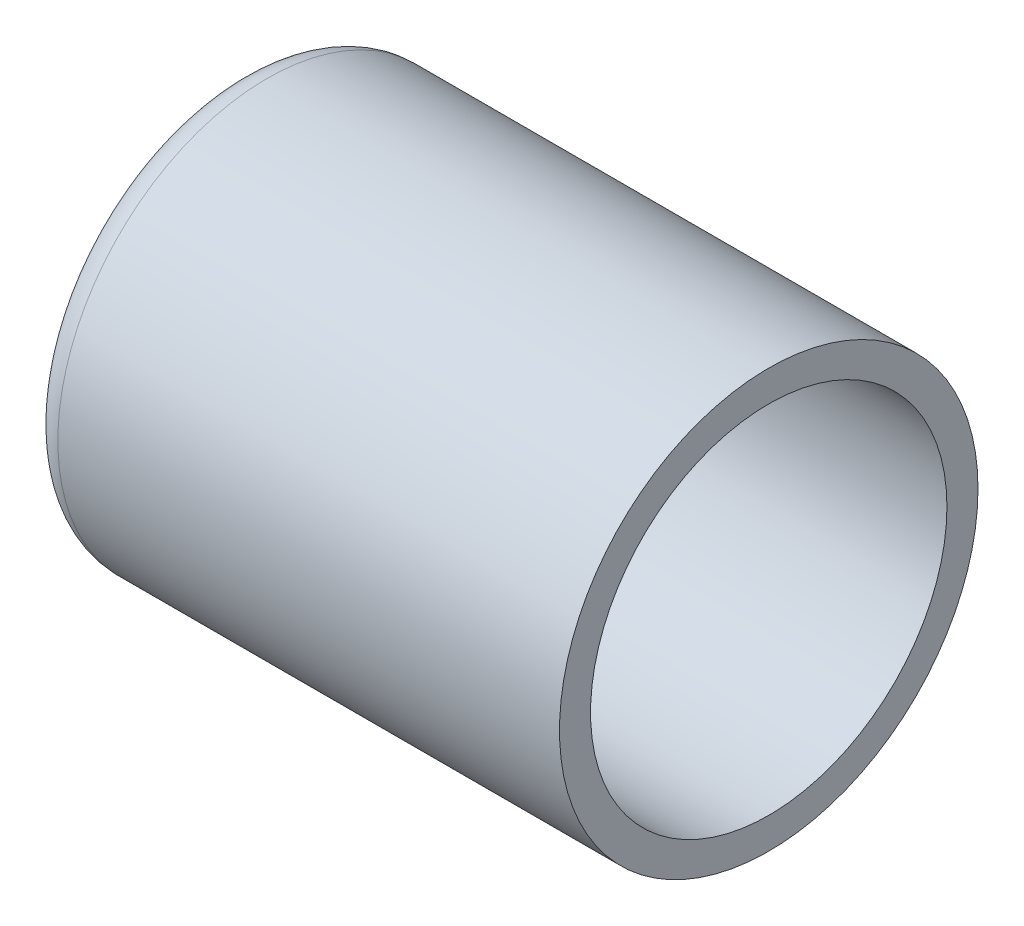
ISO-10303-21;
HEADER;
FILE_DESCRIPTION(('STEP AP214'),'2;1');
FILE_NAME('part.step','',(''),(''),'','','');
FILE_SCHEMA(('AUTOMOTIVE_DESIGN { 1 0 10303 214 1 1 1 1 }'));
ENDSEC;
DATA;
#1=APPLICATION_CONTEXT('core data for automotive mechanical design processes');
#2=APPLICATION_PROTOCOL_DEFINITION('international standard','automotive_design',2000,#1);
#3=PRODUCT_CONTEXT('',#1,'mechanical');
#4=PRODUCT('Part','Part','',(#3));
#5=PRODUCT_RELATED_PRODUCT_CATEGORY('part','',(#4));
#6=PRODUCT_DEFINITION_FORMATION('','',#4);
#7=PRODUCT_DEFINITION_CONTEXT('part definition',#1,'design');
#8=PRODUCT_DEFINITION('design','',#6,#7);
#9=PRODUCT_DEFINITION_SHAPE('','',#8);
#10=(LENGTH_UNIT() NAMED_UNIT(*) SI_UNIT(.MILLI.,.METRE.));
#11=(NAMED_UNIT(*) PLANE_ANGLE_UNIT() SI_UNIT($,.RADIAN.));
#12=(NAMED_UNIT(*) SI_UNIT($,.STERADIAN.) SOLID_ANGLE_UNIT());
#13=UNCERTAINTY_MEASURE_WITH_UNIT(LENGTH_MEASURE(1.E-05),#10,'distance_accuracy_value','');
#14=(GEOMETRIC_REPRESENTATION_CONTEXT(3) GLOBAL_UNCERTAINTY_ASSIGNED_CONTEXT((#13)) GLOBAL_UNIT_ASSIGNED_CONTEXT((#10,
#11,#12)) REPRESENTATION_CONTEXT('',''));
#15=CARTESIAN_POINT('',(0.,0.,0.));
#16=DIRECTION('',(0.,0.,1.));
#17=DIRECTION('',(1.,0.,0.));
#18=AXIS2_PLACEMENT_3D('',#15,#16,#17);
#19=CARTESIAN_POINT('',(14.097,0.,0.));
#20=DIRECTION('',(-1.,0.,0.));
#21=DIRECTION('',(0.,0.,1.));
#22=AXIS2_PLACEMENT_3D('',#19,#20,#21);
#23=CYLINDRICAL_SURFACE('',#22,5.5626);
#24=CARTESIAN_POINT('',(0.762000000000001,0.,0.));
#25=DIRECTION('',(1.,0.,0.));
#26=DIRECTION('',(0.,0.,-1.));
#27=AXIS2_PLACEMENT_3D('',#24,#25,#26);
#28=CIRCLE('',#27,5.5626);
#29=CARTESIAN_POINT('',(0.762000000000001,0.,-5.5626));
#30=VERTEX_POINT('',#29);
#31=EDGE_CURVE('E45',#30,#30,#28,.T.);
#32=ORIENTED_EDGE('',*,*,#31,.T.);
#33=EDGE_LOOP('',(#32));
#34=FACE_BOUND('',#33,.T.);
#35=CARTESIAN_POINT('',(14.097,0.,0.));
#36=DIRECTION('',(1.,0.,0.));
#37=DIRECTION('',(0.,0.,-1.));
#38=AXIS2_PLACEMENT_3D('',#35,#36,#37);
#39=CIRCLE('',#38,5.5626);
#40=CARTESIAN_POINT('',(14.097,0.,-5.5626));
#41=VERTEX_POINT('',#40);
#42=EDGE_CURVE('E50',#41,#41,#39,.T.);
#43=ORIENTED_EDGE('',*,*,#42,.F.);
#44=EDGE_LOOP('',(#43));
#45=FACE_BOUND('',#44,.T.);
#46=ADVANCED_FACE('F30',(#34,#45),#23,.T.);
#47=CARTESIAN_POINT('',(14.097,0.,0.));
#48=DIRECTION('',(1.,0.,0.));
#49=DIRECTION('',(0.,0.,-1.));
#50=AXIS2_PLACEMENT_3D('',#47,#48,#49);
#51=PLANE('',#50);
#52=CARTESIAN_POINT('',(14.097,0.,0.));
#53=DIRECTION('',(1.,0.,0.));
#54=DIRECTION('',(0.,0.,-1.));
#55=AXIS2_PLACEMENT_3D('',#52,#53,#54);
#56=CIRCLE('',#55,4.7371);
#57=CARTESIAN_POINT('',(14.097,0.,-4.7371));
#58=VERTEX_POINT('',#57);
#59=EDGE_CURVE('E54',#58,#58,#56,.T.);
#60=ORIENTED_EDGE('',*,*,#59,.F.);
#61=EDGE_LOOP('',(#60));
#62=FACE_BOUND('',#61,.T.);
#63=ORIENTED_EDGE('',*,*,#42,.T.);
#64=EDGE_LOOP('',(#63));
#65=FACE_BOUND('',#64,.T.);
#66=ADVANCED_FACE('F78',(#62,#65),#51,.T.);
#67=CARTESIAN_POINT('',(0.,0.,0.));
#68=DIRECTION('',(1.,0.,0.));
#69=DIRECTION('',(0.,0.,-1.));
#70=AXIS2_PLACEMENT_3D('',#67,#68,#69);
#71=PLANE('',#70);
#72=CARTESIAN_POINT('',(0.,0.,0.));
#73=DIRECTION('',(1.,0.,0.));
#74=DIRECTION('',(0.,0.,-1.));
#75=AXIS2_PLACEMENT_3D('',#72,#73,#74);
#76=CIRCLE('',#75,2.22250000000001);
#77=CARTESIAN_POINT('',(0.,0.,-2.22250000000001));
#78=VERTEX_POINT('',#77);
#79=EDGE_CURVE('E10',#78,#78,#76,.T.);
#80=ORIENTED_EDGE('',*,*,#79,.T.);
#81=EDGE_LOOP('',(#80));
#82=FACE_BOUND('',#81,.T.);
#83=CARTESIAN_POINT('',(0.,0.,0.));
#84=DIRECTION('',(1.,0.,0.));
#85=DIRECTION('',(0.,0.,-1.));
#86=AXIS2_PLACEMENT_3D('',#83,#84,#85);
#87=CIRCLE('',#86,4.8006);
#88=CARTESIAN_POINT('',(0.,0.,-4.8006));
#89=VERTEX_POINT('',#88);
#90=EDGE_CURVE('E41',#89,#89,#87,.F.);
#91=ORIENTED_EDGE('',*,*,#90,.T.);
#92=EDGE_LOOP('',(#91));
#93=FACE_BOUND('',#92,.T.);
#94=ADVANCED_FACE('F84',(#82,#93),#71,.F.);
#95=CARTESIAN_POINT('',(2.413,0.,0.));
#96=DIRECTION('',(1.,0.,0.));
#97=DIRECTION('',(0.,0.,-1.));
#98=AXIS2_PLACEMENT_3D('',#95,#96,#97);
#99=CYLINDRICAL_SURFACE('',#98,4.7371);
#100=CARTESIAN_POINT('',(2.413,0.,0.));
#101=DIRECTION('',(1.,0.,0.));
#102=DIRECTION('',(0.,0.,-1.));
#103=AXIS2_PLACEMENT_3D('',#100,#101,#102);
#104=CIRCLE('',#103,4.7371);
#105=CARTESIAN_POINT('',(2.413,0.,-4.7371));
#106=VERTEX_POINT('',#105);
#107=EDGE_CURVE('E53',#106,#106,#104,.T.);
#108=ORIENTED_EDGE('',*,*,#107,.F.);
#109=EDGE_LOOP('',(#108));
#110=FACE_BOUND('',#109,.T.);
#111=ORIENTED_EDGE('',*,*,#59,.T.);
#112=EDGE_LOOP('',(#111));
#113=FACE_BOUND('',#112,.T.);
#114=ADVANCED_FACE('F90',(#110,#113),#99,.F.);
#115=CARTESIAN_POINT('',(2.413,0.,0.));
#116=DIRECTION('',(1.,0.,0.));
#117=DIRECTION('',(0.,0.,-1.));
#118=AXIS2_PLACEMENT_3D('',#115,#116,#117);
#119=PLANE('',#118);
#120=CARTESIAN_POINT('',(2.413,0.,0.));
#121=DIRECTION('',(1.,0.,0.));
#122=DIRECTION('',(0.,0.,-1.));
#123=AXIS2_PLACEMENT_3D('',#120,#121,#122);
#124=CIRCLE('',#123,1.5875);
#125=CARTESIAN_POINT('',(2.413,0.,-1.5875));
#126=VERTEX_POINT('',#125);
#127=EDGE_CURVE('E57',#126,#126,#124,.F.);
#128=ORIENTED_EDGE('',*,*,#127,.T.);
#129=EDGE_LOOP('',(#128));
#130=FACE_BOUND('',#129,.T.);
#131=ORIENTED_EDGE('',*,*,#107,.T.);
#132=EDGE_LOOP('',(#131));
#133=FACE_BOUND('',#132,.T.);
#134=ADVANCED_FACE('F63',(#130,#133),#119,.T.);
#135=CARTESIAN_POINT('',(0.762000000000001,0.,0.));
#136=DIRECTION('',(1.,0.,0.));
#137=DIRECTION('',(0.,0.,-1.));
#138=AXIS2_PLACEMENT_3D('',#135,#136,#137);
#139=TOROIDAL_SURFACE('',#138,4.8006,0.762);
#140=ORIENTED_EDGE('',*,*,#90,.F.);
#141=EDGE_LOOP('',(#140));
#142=FACE_BOUND('',#141,.T.);
#143=ORIENTED_EDGE('',*,*,#31,.F.);
#144=EDGE_LOOP('',(#143));
#145=FACE_BOUND('',#144,.T.);
#146=ADVANCED_FACE('F68',(#142,#145),#139,.T.);
#147=CARTESIAN_POINT('',(14.098,0.,0.));
#148=DIRECTION('',(-1.,0.,0.));
#149=DIRECTION('',(0.,0.,1.));
#150=AXIS2_PLACEMENT_3D('',#147,#148,#149);
#151=CYLINDRICAL_SURFACE('',#150,1.5875);
#152=CARTESIAN_POINT('',(0.635000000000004,0.,0.));
#153=DIRECTION('',(1.,0.,0.));
#154=DIRECTION('',(0.,0.,-1.));
#155=AXIS2_PLACEMENT_3D('',#152,#153,#154);
#156=CIRCLE('',#155,1.5875);
#157=CARTESIAN_POINT('',(0.635000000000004,0.,-1.5875));
#158=VERTEX_POINT('',#157);
#159=EDGE_CURVE('E37',#158,#158,#156,.F.);
#160=ORIENTED_EDGE('',*,*,#159,.T.);
#161=EDGE_LOOP('',(#160));
#162=FACE_BOUND('',#161,.T.);
#163=ORIENTED_EDGE('',*,*,#127,.F.);
#164=EDGE_LOOP('',(#163));
#165=FACE_BOUND('',#164,.T.);
#166=ADVANCED_FACE('F66',(#162,#165),#151,.F.);
#167=CARTESIAN_POINT('',(0.635000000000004,0.,0.));
#168=DIRECTION('',(-1.,0.,0.));
#169=DIRECTION('',(0.,0.,1.));
#170=AXIS2_PLACEMENT_3D('',#167,#168,#169);
#171=CONICAL_SURFACE('',#170,1.5875,0.78539816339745);
#172=ORIENTED_EDGE('',*,*,#79,.F.);
#173=EDGE_LOOP('',(#172));
#174=FACE_BOUND('',#173,.T.);
#175=ORIENTED_EDGE('',*,*,#159,.F.);
#176=EDGE_LOOP('',(#175));
#177=FACE_BOUND('',#176,.T.);
#178=ADVANCED_FACE('F32',(#174,#177),#171,.F.);
#179=CLOSED_SHELL('',(#46,#66,#94,#114,#134,#146,#166,#178));
#180=MANIFOLD_SOLID_BREP('B2',#179);
#181=ADVANCED_BREP_SHAPE_REPRESENTATION('',(#18,#180),#14);
#182=SHAPE_DEFINITION_REPRESENTATION(#9,#181);
ENDSEC;
END-ISO-10303-21;
